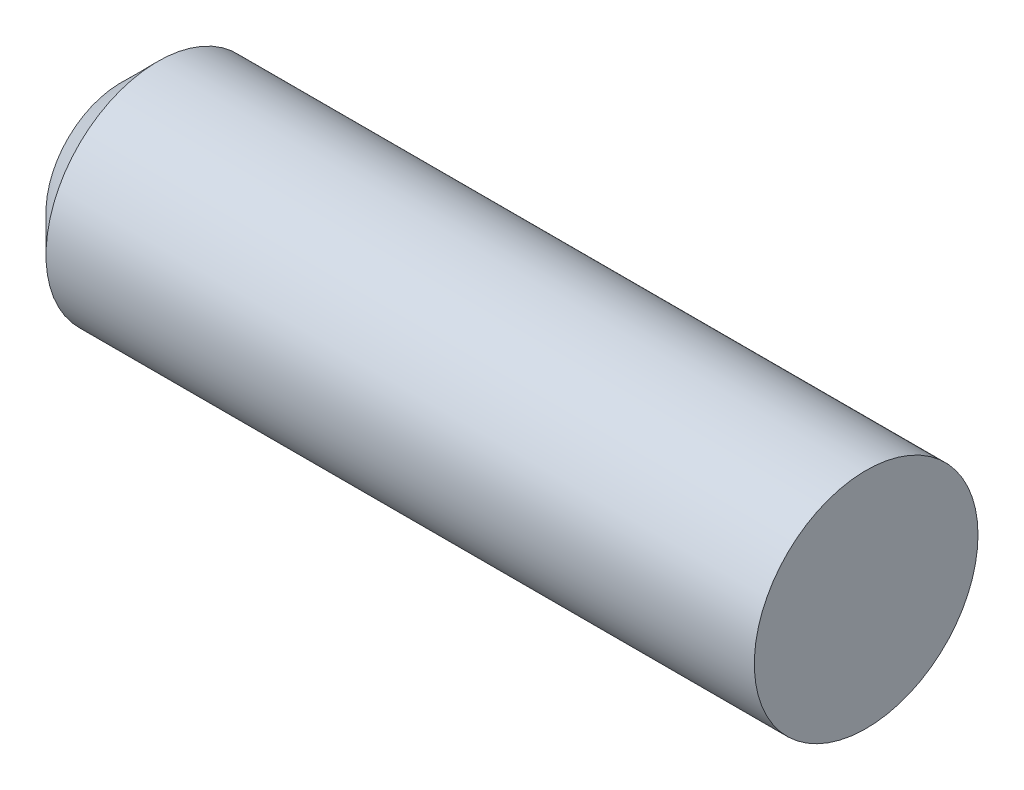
ISO-10303-21;
HEADER;
FILE_DESCRIPTION(('STEP AP214'),'2;1');
FILE_NAME('part.step','',(''),(''),'','','');
FILE_SCHEMA(('AUTOMOTIVE_DESIGN { 1 0 10303 214 1 1 1 1 }'));
ENDSEC;
DATA;
#1=APPLICATION_CONTEXT('core data for automotive mechanical design processes');
#2=APPLICATION_PROTOCOL_DEFINITION('international standard','automotive_design',2000,#1);
#3=PRODUCT_CONTEXT('',#1,'mechanical');
#4=PRODUCT('Part','Part','',(#3));
#5=PRODUCT_RELATED_PRODUCT_CATEGORY('part','',(#4));
#6=PRODUCT_DEFINITION_FORMATION('','',#4);
#7=PRODUCT_DEFINITION_CONTEXT('part definition',#1,'design');
#8=PRODUCT_DEFINITION('design','',#6,#7);
#9=PRODUCT_DEFINITION_SHAPE('','',#8);
#10=(LENGTH_UNIT() NAMED_UNIT(*) SI_UNIT(.MILLI.,.METRE.));
#11=(NAMED_UNIT(*) PLANE_ANGLE_UNIT() SI_UNIT($,.RADIAN.));
#12=(NAMED_UNIT(*) SI_UNIT($,.STERADIAN.) SOLID_ANGLE_UNIT());
#13=UNCERTAINTY_MEASURE_WITH_UNIT(LENGTH_MEASURE(1.E-05),#10,'distance_accuracy_value','');
#14=(GEOMETRIC_REPRESENTATION_CONTEXT(3) GLOBAL_UNCERTAINTY_ASSIGNED_CONTEXT((#13)) GLOBAL_UNIT_ASSIGNED_CONTEXT((#10,
#11,#12)) REPRESENTATION_CONTEXT('',''));
#15=CARTESIAN_POINT('',(0.,0.,0.));
#16=DIRECTION('',(0.,0.,1.));
#17=DIRECTION('',(1.,0.,0.));
#18=AXIS2_PLACEMENT_3D('',#15,#16,#17);
#19=CARTESIAN_POINT('',(10.,0.,0.));
#20=DIRECTION('',(-1.,0.,0.));
#21=DIRECTION('',(0.,0.,1.));
#22=AXIS2_PLACEMENT_3D('',#19,#20,#21);
#23=CYLINDRICAL_SURFACE('',#22,1.5);
#24=CARTESIAN_POINT('',(0.5,0.,0.));
#25=DIRECTION('',(1.,0.,0.));
#26=DIRECTION('',(0.,0.,-1.));
#27=AXIS2_PLACEMENT_3D('',#24,#25,#26);
#28=CIRCLE('',#27,1.5);
#29=CARTESIAN_POINT('',(0.5,0.,-1.5));
#30=VERTEX_POINT('',#29);
#31=EDGE_CURVE('E49',#30,#30,#28,.T.);
#32=ORIENTED_EDGE('',*,*,#31,.T.);
#33=EDGE_LOOP('',(#32));
#34=FACE_BOUND('',#33,.T.);
#35=CARTESIAN_POINT('',(10.,0.,0.));
#36=DIRECTION('',(1.,0.,0.));
#37=DIRECTION('',(0.,0.,-1.));
#38=AXIS2_PLACEMENT_3D('',#35,#36,#37);
#39=CIRCLE('',#38,1.5);
#40=CARTESIAN_POINT('',(10.,0.,-1.5));
#41=VERTEX_POINT('',#40);
#42=EDGE_CURVE('E53',#41,#41,#39,.T.);
#43=ORIENTED_EDGE('',*,*,#42,.F.);
#44=EDGE_LOOP('',(#43));
#45=FACE_BOUND('',#44,.T.);
#46=ADVANCED_FACE('F41',(#34,#45),#23,.T.);
#47=CARTESIAN_POINT('',(10.,0.,0.));
#48=DIRECTION('',(1.,0.,0.));
#49=DIRECTION('',(0.,0.,-1.));
#50=AXIS2_PLACEMENT_3D('',#47,#48,#49);
#51=PLANE('',#50);
#52=ORIENTED_EDGE('',*,*,#42,.T.);
#53=EDGE_LOOP('',(#52));
#54=FACE_BOUND('',#53,.T.);
#55=ADVANCED_FACE('F60',(#54),#51,.T.);
#56=CARTESIAN_POINT('',(0.,0.,0.));
#57=DIRECTION('',(1.,0.,0.));
#58=DIRECTION('',(0.,0.,-1.));
#59=AXIS2_PLACEMENT_3D('',#56,#57,#58);
#60=PLANE('',#59);
#61=CARTESIAN_POINT('',(0.,0.,0.));
#62=DIRECTION('',(1.,0.,0.));
#63=DIRECTION('',(0.,0.,-1.));
#64=AXIS2_PLACEMENT_3D('',#61,#62,#63);
#65=CIRCLE('',#64,0.999999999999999);
#66=CARTESIAN_POINT('',(0.,0.,-0.999999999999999));
#67=VERTEX_POINT('',#66);
#68=EDGE_CURVE('E10',#67,#67,#65,.F.);
#69=ORIENTED_EDGE('',*,*,#68,.T.);
#70=EDGE_LOOP('',(#69));
#71=FACE_BOUND('',#70,.T.);
#72=ADVANCED_FACE('F67',(#71),#60,.F.);
#73=CARTESIAN_POINT('',(0.5,0.,0.));
#74=DIRECTION('',(1.,0.,0.));
#75=DIRECTION('',(0.,0.,-1.));
#76=AXIS2_PLACEMENT_3D('',#73,#74,#75);
#77=CONICAL_SURFACE('',#76,1.5,0.78539816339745);
#78=ORIENTED_EDGE('',*,*,#68,.F.);
#79=EDGE_LOOP('',(#78));
#80=FACE_BOUND('',#79,.T.);
#81=ORIENTED_EDGE('',*,*,#31,.F.);
#82=EDGE_LOOP('',(#81));
#83=FACE_BOUND('',#82,.T.);
#84=ADVANCED_FACE('F44',(#80,#83),#77,.T.);
#85=CLOSED_SHELL('',(#46,#55,#72,#84));
#86=MANIFOLD_SOLID_BREP('B2',#85);
#87=ADVANCED_BREP_SHAPE_REPRESENTATION('',(#18,#86),#14);
#88=SHAPE_DEFINITION_REPRESENTATION(#9,#87);
ENDSEC;
END-ISO-10303-21;
